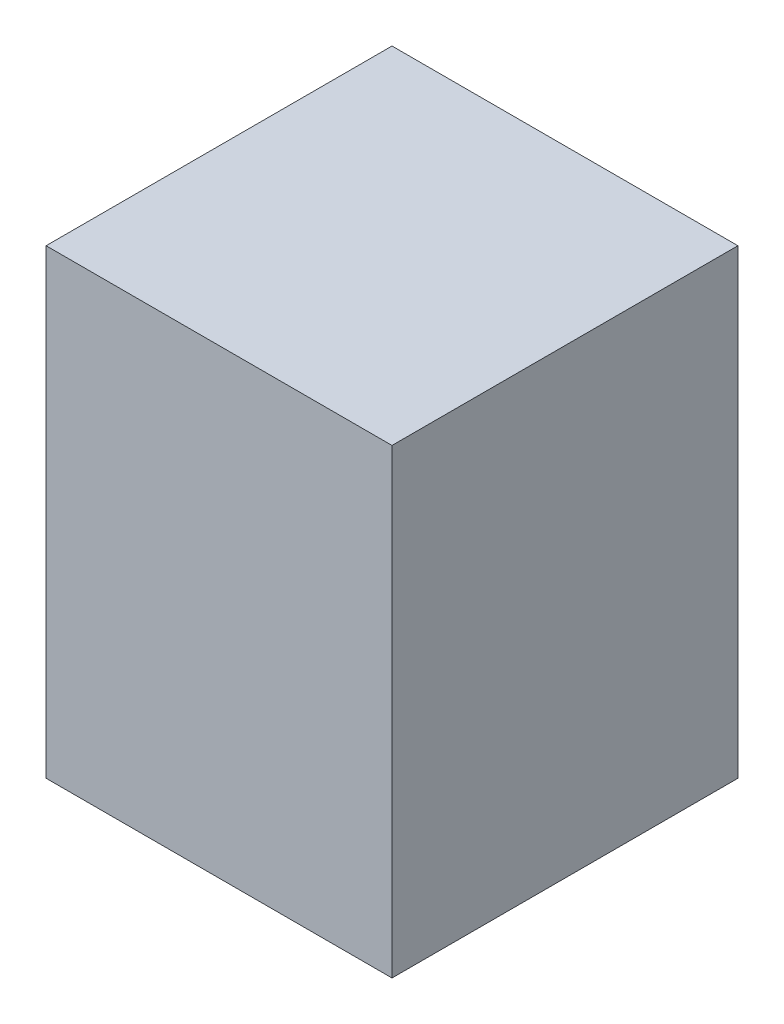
from build123d import *

# Parameters (mm, degrees)
ESQUISSE1_W      = 22.5
ESQUISSE1_H      = 30
EXTRUSION1_DEPTH = 22.5


with BuildPart() as part:
    # Esquisse1 → Extrusion1 (new body)
    with BuildSketch(Plane.XY):
        with Locations((146.25, -15)):
            Rectangle(ESQUISSE1_W, ESQUISSE1_H)
    extrude(amount=EXTRUSION1_DEPTH)


solid = part.part
